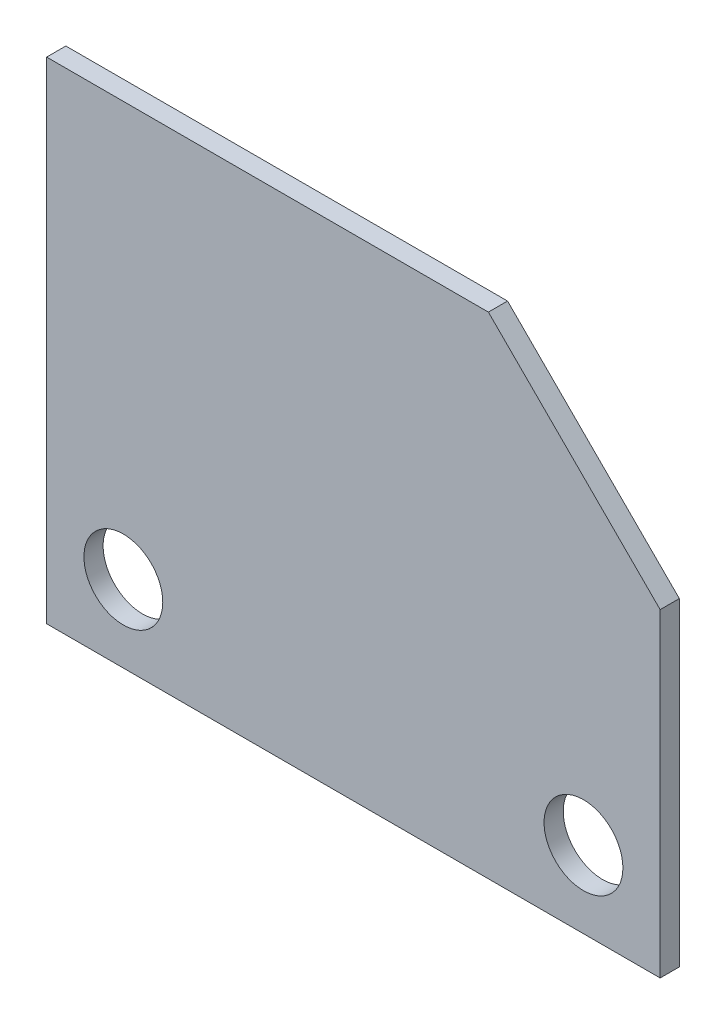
ISO-10303-21;
HEADER;
FILE_DESCRIPTION(('STEP AP214'),'2;1');
FILE_NAME('part.step','',(''),(''),'','','');
FILE_SCHEMA(('AUTOMOTIVE_DESIGN { 1 0 10303 214 1 1 1 1 }'));
ENDSEC;
DATA;
#1=APPLICATION_CONTEXT('core data for automotive mechanical design processes');
#2=APPLICATION_PROTOCOL_DEFINITION('international standard','automotive_design',2000,#1);
#3=PRODUCT_CONTEXT('',#1,'mechanical');
#4=PRODUCT('Part','Part','',(#3));
#5=PRODUCT_RELATED_PRODUCT_CATEGORY('part','',(#4));
#6=PRODUCT_DEFINITION_FORMATION('','',#4);
#7=PRODUCT_DEFINITION_CONTEXT('part definition',#1,'design');
#8=PRODUCT_DEFINITION('design','',#6,#7);
#9=PRODUCT_DEFINITION_SHAPE('','',#8);
#10=(LENGTH_UNIT() NAMED_UNIT(*) SI_UNIT(.MILLI.,.METRE.));
#11=(NAMED_UNIT(*) PLANE_ANGLE_UNIT() SI_UNIT($,.RADIAN.));
#12=(NAMED_UNIT(*) SI_UNIT($,.STERADIAN.) SOLID_ANGLE_UNIT());
#13=UNCERTAINTY_MEASURE_WITH_UNIT(LENGTH_MEASURE(1.E-05),#10,'distance_accuracy_value','');
#14=(GEOMETRIC_REPRESENTATION_CONTEXT(3) GLOBAL_UNCERTAINTY_ASSIGNED_CONTEXT((#13)) GLOBAL_UNIT_ASSIGNED_CONTEXT((#10,
#11,#12)) REPRESENTATION_CONTEXT('',''));
#15=CARTESIAN_POINT('',(0.,0.,0.));
#16=DIRECTION('',(0.,0.,1.));
#17=DIRECTION('',(1.,0.,0.));
#18=AXIS2_PLACEMENT_3D('',#15,#16,#17);
#19=CARTESIAN_POINT('',(-12.7,20.32,0.79375));
#20=DIRECTION('',(1.,0.,0.));
#21=DIRECTION('',(0.,0.,-1.));
#22=AXIS2_PLACEMENT_3D('',#19,#20,#21);
#23=PLANE('',#22);
#24=DIRECTION('',(0.,-1.,0.));
#25=VECTOR('',#24,1.);
#26=CARTESIAN_POINT('',(-12.7,20.32,0.));
#27=LINE('',#26,#25);
#28=CARTESIAN_POINT('',(-12.7,20.32,0.));
#29=VERTEX_POINT('',#28);
#30=CARTESIAN_POINT('',(-12.7,0.,0.));
#31=VERTEX_POINT('',#30);
#32=EDGE_CURVE('E78',#29,#31,#27,.T.);
#33=ORIENTED_EDGE('',*,*,#32,.T.);
#34=DIRECTION('',(0.,0.,-1.));
#35=VECTOR('',#34,1.);
#36=CARTESIAN_POINT('',(-12.7,0.,0.79375));
#37=LINE('',#36,#35);
#38=CARTESIAN_POINT('',(-12.7,0.,0.79375));
#39=VERTEX_POINT('',#38);
#40=EDGE_CURVE('E85',#39,#31,#37,.T.);
#41=ORIENTED_EDGE('',*,*,#40,.F.);
#42=DIRECTION('',(0.,-1.,0.));
#43=VECTOR('',#42,1.);
#44=CARTESIAN_POINT('',(-12.7,20.32,0.79375));
#45=LINE('',#44,#43);
#46=CARTESIAN_POINT('',(-12.7,20.32,0.79375));
#47=VERTEX_POINT('',#46);
#48=EDGE_CURVE('E107',#47,#39,#45,.T.);
#49=ORIENTED_EDGE('',*,*,#48,.F.);
#50=DIRECTION('',(0.,0.,-1.));
#51=VECTOR('',#50,1.);
#52=CARTESIAN_POINT('',(-12.7,20.32,0.79375));
#53=LINE('',#52,#51);
#54=EDGE_CURVE('E96',#47,#29,#53,.T.);
#55=ORIENTED_EDGE('',*,*,#54,.T.);
#56=EDGE_LOOP('',(#33,#41,#49,#55));
#57=FACE_BOUND('',#56,.T.);
#58=ADVANCED_FACE('F30',(#57),#23,.F.);
#59=CARTESIAN_POINT('',(-12.7,0.,0.79375));
#60=DIRECTION('',(0.,1.,0.));
#61=DIRECTION('',(-1.,0.,0.));
#62=AXIS2_PLACEMENT_3D('',#59,#60,#61);
#63=PLANE('',#62);
#64=DIRECTION('',(1.,0.,0.));
#65=VECTOR('',#64,1.);
#66=CARTESIAN_POINT('',(-12.7,0.,0.));
#67=LINE('',#66,#65);
#68=CARTESIAN_POINT('',(12.7,0.,0.));
#69=VERTEX_POINT('',#68);
#70=EDGE_CURVE('E74',#31,#69,#67,.T.);
#71=ORIENTED_EDGE('',*,*,#70,.T.);
#72=DIRECTION('',(0.,0.,-1.));
#73=VECTOR('',#72,1.);
#74=CARTESIAN_POINT('',(12.7,0.,0.79375));
#75=LINE('',#74,#73);
#76=CARTESIAN_POINT('',(12.7,0.,0.79375));
#77=VERTEX_POINT('',#76);
#78=EDGE_CURVE('E92',#77,#69,#75,.T.);
#79=ORIENTED_EDGE('',*,*,#78,.F.);
#80=DIRECTION('',(1.,0.,0.));
#81=VECTOR('',#80,1.);
#82=CARTESIAN_POINT('',(-12.7,0.,0.79375));
#83=LINE('',#82,#81);
#84=EDGE_CURVE('E87',#39,#77,#83,.T.);
#85=ORIENTED_EDGE('',*,*,#84,.F.);
#86=ORIENTED_EDGE('',*,*,#40,.T.);
#87=EDGE_LOOP('',(#71,#79,#85,#86));
#88=FACE_BOUND('',#87,.T.);
#89=ADVANCED_FACE('F86',(#88),#63,.F.);
#90=CARTESIAN_POINT('',(12.7,20.32,0.79375));
#91=DIRECTION('',(-1.,0.,0.));
#92=DIRECTION('',(0.,-1.,0.));
#93=AXIS2_PLACEMENT_3D('',#90,#91,#92);
#94=PLANE('',#93);
#95=DIRECTION('',(0.,1.,0.));
#96=VECTOR('',#95,1.);
#97=CARTESIAN_POINT('',(12.7,20.32,0.));
#98=LINE('',#97,#96);
#99=CARTESIAN_POINT('',(12.7,13.208,0.));
#100=VERTEX_POINT('',#99);
#101=EDGE_CURVE('E79',#69,#100,#98,.T.);
#102=ORIENTED_EDGE('',*,*,#101,.T.);
#103=DIRECTION('',(0.,0.,1.));
#104=VECTOR('',#103,1.);
#105=CARTESIAN_POINT('',(12.7,13.208,0.79375));
#106=LINE('',#105,#104);
#107=CARTESIAN_POINT('',(12.7,13.208,0.79375));
#108=VERTEX_POINT('',#107);
#109=EDGE_CURVE('E37',#100,#108,#106,.T.);
#110=ORIENTED_EDGE('',*,*,#109,.T.);
#111=DIRECTION('',(0.,1.,0.));
#112=VECTOR('',#111,1.);
#113=CARTESIAN_POINT('',(12.7,20.32,0.79375));
#114=LINE('',#113,#112);
#115=EDGE_CURVE('E110',#77,#108,#114,.T.);
#116=ORIENTED_EDGE('',*,*,#115,.F.);
#117=ORIENTED_EDGE('',*,*,#78,.T.);
#118=EDGE_LOOP('',(#102,#110,#116,#117));
#119=FACE_BOUND('',#118,.T.);
#120=ADVANCED_FACE('F127',(#119),#94,.F.);
#121=CARTESIAN_POINT('',(-12.7,20.32,0.79375));
#122=DIRECTION('',(0.,-1.,0.));
#123=DIRECTION('',(1.,0.,0.));
#124=AXIS2_PLACEMENT_3D('',#121,#122,#123);
#125=PLANE('',#124);
#126=DIRECTION('',(-1.,0.,0.));
#127=VECTOR('',#126,1.);
#128=CARTESIAN_POINT('',(-12.7,20.32,0.79375));
#129=LINE('',#128,#127);
#130=CARTESIAN_POINT('',(5.588,20.32,0.79375));
#131=VERTEX_POINT('',#130);
#132=EDGE_CURVE('E112',#131,#47,#129,.T.);
#133=ORIENTED_EDGE('',*,*,#132,.F.);
#134=DIRECTION('',(0.,0.,-1.));
#135=VECTOR('',#134,1.);
#136=CARTESIAN_POINT('',(5.588,20.32,0.79375));
#137=LINE('',#136,#135);
#138=CARTESIAN_POINT('',(5.58799999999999,20.32,0.));
#139=VERTEX_POINT('',#138);
#140=EDGE_CURVE('E91',#131,#139,#137,.T.);
#141=ORIENTED_EDGE('',*,*,#140,.T.);
#142=DIRECTION('',(-1.,0.,0.));
#143=VECTOR('',#142,1.);
#144=CARTESIAN_POINT('',(-12.7,20.32,0.));
#145=LINE('',#144,#143);
#146=EDGE_CURVE('E105',#139,#29,#145,.T.);
#147=ORIENTED_EDGE('',*,*,#146,.T.);
#148=ORIENTED_EDGE('',*,*,#54,.F.);
#149=EDGE_LOOP('',(#133,#141,#147,#148));
#150=FACE_BOUND('',#149,.T.);
#151=ADVANCED_FACE('F121',(#150),#125,.F.);
#152=CARTESIAN_POINT('',(-12.7,20.32,0.79375));
#153=DIRECTION('',(0.,0.,1.));
#154=DIRECTION('',(1.,0.,0.));
#155=AXIS2_PLACEMENT_3D('',#152,#153,#154);
#156=PLANE('',#155);
#157=CARTESIAN_POINT('',(-9.525,3.175,0.79375));
#158=DIRECTION('',(0.,0.,1.));
#159=DIRECTION('',(1.,0.,0.));
#160=AXIS2_PLACEMENT_3D('',#157,#158,#159);
#161=CIRCLE('',#160,1.63194999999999);
#162=CARTESIAN_POINT('',(-7.89305000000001,3.175,0.79375));
#163=VERTEX_POINT('',#162);
#164=EDGE_CURVE('E211',#163,#163,#161,.T.);
#165=ORIENTED_EDGE('',*,*,#164,.F.);
#166=EDGE_LOOP('',(#165));
#167=FACE_BOUND('',#166,.T.);
#168=CARTESIAN_POINT('',(9.525,3.175,0.79375));
#169=DIRECTION('',(0.,0.,1.));
#170=DIRECTION('',(1.,0.,0.));
#171=AXIS2_PLACEMENT_3D('',#168,#169,#170);
#172=CIRCLE('',#171,1.63194999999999);
#173=CARTESIAN_POINT('',(11.15695,3.175,0.79375));
#174=VERTEX_POINT('',#173);
#175=EDGE_CURVE('E100',#174,#174,#172,.T.);
#176=ORIENTED_EDGE('',*,*,#175,.F.);
#177=EDGE_LOOP('',(#176));
#178=FACE_BOUND('',#177,.T.);
#179=ORIENTED_EDGE('',*,*,#115,.T.);
#180=DIRECTION('',(0.707106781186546,-0.707106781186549,0.));
#181=VECTOR('',#180,1.);
#182=CARTESIAN_POINT('',(-3.55599999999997,29.464,0.79375));
#183=LINE('',#182,#181);
#184=EDGE_CURVE('E11',#108,#131,#183,.F.);
#185=ORIENTED_EDGE('',*,*,#184,.T.);
#186=ORIENTED_EDGE('',*,*,#132,.T.);
#187=ORIENTED_EDGE('',*,*,#48,.T.);
#188=ORIENTED_EDGE('',*,*,#84,.T.);
#189=EDGE_LOOP('',(#179,#185,#186,#187,#188));
#190=FACE_BOUND('',#189,.T.);
#191=ADVANCED_FACE('F126',(#167,#178,#190),#156,.T.);
#192=CARTESIAN_POINT('',(-12.7,20.32,0.));
#193=DIRECTION('',(0.,0.,1.));
#194=DIRECTION('',(1.,0.,0.));
#195=AXIS2_PLACEMENT_3D('',#192,#193,#194);
#196=PLANE('',#195);
#197=CARTESIAN_POINT('',(-9.525,3.175,0.));
#198=DIRECTION('',(0.,0.,1.));
#199=DIRECTION('',(1.,0.,0.));
#200=AXIS2_PLACEMENT_3D('',#197,#198,#199);
#201=CIRCLE('',#200,1.63195);
#202=CARTESIAN_POINT('',(-7.89305,3.175,0.));
#203=VERTEX_POINT('',#202);
#204=EDGE_CURVE('E205',#203,#203,#201,.T.);
#205=ORIENTED_EDGE('',*,*,#204,.T.);
#206=EDGE_LOOP('',(#205));
#207=FACE_BOUND('',#206,.T.);
#208=CARTESIAN_POINT('',(9.525,3.175,0.));
#209=DIRECTION('',(0.,0.,1.));
#210=DIRECTION('',(1.,0.,0.));
#211=AXIS2_PLACEMENT_3D('',#208,#209,#210);
#212=CIRCLE('',#211,1.63195);
#213=CARTESIAN_POINT('',(11.15695,3.175,0.));
#214=VERTEX_POINT('',#213);
#215=EDGE_CURVE('E97',#214,#214,#212,.T.);
#216=ORIENTED_EDGE('',*,*,#215,.T.);
#217=EDGE_LOOP('',(#216));
#218=FACE_BOUND('',#217,.T.);
#219=ORIENTED_EDGE('',*,*,#146,.F.);
#220=DIRECTION('',(-0.707106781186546,0.707106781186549,0.));
#221=VECTOR('',#220,1.);
#222=CARTESIAN_POINT('',(5.588,20.32,0.));
#223=LINE('',#222,#221);
#224=EDGE_CURVE('E51',#139,#100,#223,.F.);
#225=ORIENTED_EDGE('',*,*,#224,.T.);
#226=ORIENTED_EDGE('',*,*,#101,.F.);
#227=ORIENTED_EDGE('',*,*,#70,.F.);
#228=ORIENTED_EDGE('',*,*,#32,.F.);
#229=EDGE_LOOP('',(#219,#225,#226,#227,#228));
#230=FACE_BOUND('',#229,.T.);
#231=ADVANCED_FACE('F76',(#207,#218,#230),#196,.F.);
#232=CARTESIAN_POINT('',(9.525,3.175,0.793749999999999));
#233=DIRECTION('',(0.,0.,1.));
#234=DIRECTION('',(1.,0.,0.));
#235=AXIS2_PLACEMENT_3D('',#232,#233,#234);
#236=CYLINDRICAL_SURFACE('',#235,1.63194999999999);
#237=ORIENTED_EDGE('',*,*,#215,.F.);
#238=EDGE_LOOP('',(#237));
#239=FACE_BOUND('',#238,.T.);
#240=ORIENTED_EDGE('',*,*,#175,.T.);
#241=EDGE_LOOP('',(#240));
#242=FACE_BOUND('',#241,.T.);
#243=ADVANCED_FACE('F148',(#239,#242),#236,.F.);
#244=CARTESIAN_POINT('',(-9.525,3.175,0.793749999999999));
#245=DIRECTION('',(0.,0.,1.));
#246=DIRECTION('',(1.,0.,0.));
#247=AXIS2_PLACEMENT_3D('',#244,#245,#246);
#248=CYLINDRICAL_SURFACE('',#247,1.63194999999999);
#249=ORIENTED_EDGE('',*,*,#204,.F.);
#250=EDGE_LOOP('',(#249));
#251=FACE_BOUND('',#250,.T.);
#252=ORIENTED_EDGE('',*,*,#164,.T.);
#253=EDGE_LOOP('',(#252));
#254=FACE_BOUND('',#253,.T.);
#255=ADVANCED_FACE('F153',(#251,#254),#248,.F.);
#256=CARTESIAN_POINT('',(5.588,20.32,0.79375));
#257=DIRECTION('',(-0.707106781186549,-0.707106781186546,0.));
#258=DIRECTION('',(0.707106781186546,-0.707106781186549,0.));
#259=AXIS2_PLACEMENT_3D('',#256,#257,#258);
#260=PLANE('',#259);
#261=ORIENTED_EDGE('',*,*,#184,.F.);
#262=ORIENTED_EDGE('',*,*,#109,.F.);
#263=ORIENTED_EDGE('',*,*,#224,.F.);
#264=ORIENTED_EDGE('',*,*,#140,.F.);
#265=EDGE_LOOP('',(#261,#262,#263,#264));
#266=FACE_BOUND('',#265,.T.);
#267=ADVANCED_FACE('F124',(#266),#260,.F.);
#268=CLOSED_SHELL('',(#58,#89,#120,#151,#191,#231,#243,#255,#267));
#269=MANIFOLD_SOLID_BREP('B2',#268);
#270=ADVANCED_BREP_SHAPE_REPRESENTATION('',(#18,#269),#14);
#271=SHAPE_DEFINITION_REPRESENTATION(#9,#270);
ENDSEC;
END-ISO-10303-21;
